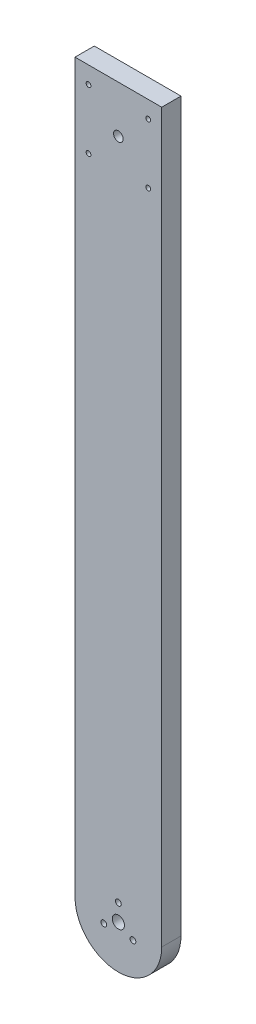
ISO-10303-21;
HEADER;
FILE_DESCRIPTION(('STEP AP214'),'2;1');
FILE_NAME('part.step','',(''),(''),'','','');
FILE_SCHEMA(('AUTOMOTIVE_DESIGN { 1 0 10303 214 1 1 1 1 }'));
ENDSEC;
DATA;
#1=APPLICATION_CONTEXT('core data for automotive mechanical design processes');
#2=APPLICATION_PROTOCOL_DEFINITION('international standard','automotive_design',2000,#1);
#3=PRODUCT_CONTEXT('',#1,'mechanical');
#4=PRODUCT('Part','Part','',(#3));
#5=PRODUCT_RELATED_PRODUCT_CATEGORY('part','',(#4));
#6=PRODUCT_DEFINITION_FORMATION('','',#4);
#7=PRODUCT_DEFINITION_CONTEXT('part definition',#1,'design');
#8=PRODUCT_DEFINITION('design','',#6,#7);
#9=PRODUCT_DEFINITION_SHAPE('','',#8);
#10=(LENGTH_UNIT() NAMED_UNIT(*) SI_UNIT(.MILLI.,.METRE.));
#11=(NAMED_UNIT(*) PLANE_ANGLE_UNIT() SI_UNIT($,.RADIAN.));
#12=(NAMED_UNIT(*) SI_UNIT($,.STERADIAN.) SOLID_ANGLE_UNIT());
#13=UNCERTAINTY_MEASURE_WITH_UNIT(LENGTH_MEASURE(1.E-05),#10,'distance_accuracy_value','');
#14=(GEOMETRIC_REPRESENTATION_CONTEXT(3) GLOBAL_UNCERTAINTY_ASSIGNED_CONTEXT((#13)) GLOBAL_UNIT_ASSIGNED_CONTEXT((#10,
#11,#12)) REPRESENTATION_CONTEXT('',''));
#15=CARTESIAN_POINT('',(0.,0.,0.));
#16=DIRECTION('',(0.,0.,1.));
#17=DIRECTION('',(1.,0.,0.));
#18=AXIS2_PLACEMENT_3D('',#15,#16,#17);
#19=CARTESIAN_POINT('',(-5.06539254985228E-12,-247.5,10.));
#20=DIRECTION('',(0.,0.,1.));
#21=DIRECTION('',(1.,0.,0.));
#22=AXIS2_PLACEMENT_3D('',#19,#20,#21);
#23=PLANE('',#22);
#24=CARTESIAN_POINT('',(7.57772228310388,-251.875000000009,10.));
#25=DIRECTION('',(0.,0.,1.));
#26=DIRECTION('',(1.,0.,0.));
#27=AXIS2_PLACEMENT_3D('',#24,#25,#26);
#28=CIRCLE('',#27,1.49999999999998);
#29=CARTESIAN_POINT('',(9.07772228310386,-251.875000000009,10.));
#30=VERTEX_POINT('',#29);
#31=EDGE_CURVE('E151',#30,#30,#28,.T.);
#32=ORIENTED_EDGE('',*,*,#31,.F.);
#33=EDGE_LOOP('',(#32));
#34=FACE_BOUND('',#33,.T.);
#35=CARTESIAN_POINT('',(5.46489483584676E-12,-238.75,10.));
#36=DIRECTION('',(0.,0.,1.));
#37=DIRECTION('',(1.,0.,0.));
#38=AXIS2_PLACEMENT_3D('',#35,#36,#37);
#39=CIRCLE('',#38,1.5);
#40=CARTESIAN_POINT('',(1.50000000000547,-238.75,10.));
#41=VERTEX_POINT('',#40);
#42=EDGE_CURVE('E139',#41,#41,#39,.T.);
#43=ORIENTED_EDGE('',*,*,#42,.F.);
#44=EDGE_LOOP('',(#43));
#45=FACE_BOUND('',#44,.T.);
#46=CARTESIAN_POINT('',(-15.4999999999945,90.1639203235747,10.));
#47=DIRECTION('',(0.,0.,1.));
#48=DIRECTION('',(-1.,0.,0.));
#49=AXIS2_PLACEMENT_3D('',#46,#47,#48);
#50=CIRCLE('',#49,1.25);
#51=CARTESIAN_POINT('',(-16.7499999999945,90.1639203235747,10.));
#52=VERTEX_POINT('',#51);
#53=EDGE_CURVE('E127',#52,#52,#50,.T.);
#54=ORIENTED_EDGE('',*,*,#53,.F.);
#55=EDGE_LOOP('',(#54));
#56=FACE_BOUND('',#55,.T.);
#57=CARTESIAN_POINT('',(15.5000000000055,121.163920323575,10.));
#58=DIRECTION('',(0.,0.,1.));
#59=DIRECTION('',(-1.,0.,0.));
#60=AXIS2_PLACEMENT_3D('',#57,#58,#59);
#61=CIRCLE('',#60,1.25);
#62=CARTESIAN_POINT('',(14.2500000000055,121.163920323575,10.));
#63=VERTEX_POINT('',#62);
#64=EDGE_CURVE('E115',#63,#63,#61,.T.);
#65=ORIENTED_EDGE('',*,*,#64,.F.);
#66=EDGE_LOOP('',(#65));
#67=FACE_BOUND('',#66,.T.);
#68=DIRECTION('',(0.,-1.,0.));
#69=VECTOR('',#68,1.);
#70=CARTESIAN_POINT('',(-22.5,130.,10.));
#71=LINE('',#70,#69);
#72=CARTESIAN_POINT('',(-22.5,130.,10.));
#73=VERTEX_POINT('',#72);
#74=CARTESIAN_POINT('',(-22.5000000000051,-247.5,10.));
#75=VERTEX_POINT('',#74);
#76=EDGE_CURVE('E85',#73,#75,#71,.T.);
#77=ORIENTED_EDGE('',*,*,#76,.T.);
#78=CARTESIAN_POINT('',(-5.06539254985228E-12,-247.5,10.));
#79=DIRECTION('',(0.,0.,1.));
#80=DIRECTION('',(1.,0.,0.));
#81=AXIS2_PLACEMENT_3D('',#78,#79,#80);
#82=CIRCLE('',#81,22.5);
#83=CARTESIAN_POINT('',(22.4999999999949,-247.5,10.));
#84=VERTEX_POINT('',#83);
#85=EDGE_CURVE('E80',#75,#84,#82,.T.);
#86=ORIENTED_EDGE('',*,*,#85,.T.);
#87=DIRECTION('',(0.,1.,0.));
#88=VECTOR('',#87,1.);
#89=CARTESIAN_POINT('',(22.5,130.,10.));
#90=LINE('',#89,#88);
#91=CARTESIAN_POINT('',(22.5,130.,10.));
#92=VERTEX_POINT('',#91);
#93=EDGE_CURVE('E83',#84,#92,#90,.T.);
#94=ORIENTED_EDGE('',*,*,#93,.T.);
#95=DIRECTION('',(-1.,0.,0.));
#96=VECTOR('',#95,1.);
#97=CARTESIAN_POINT('',(-22.5,130.,10.));
#98=LINE('',#97,#96);
#99=EDGE_CURVE('E50',#92,#73,#98,.T.);
#100=ORIENTED_EDGE('',*,*,#99,.T.);
#101=EDGE_LOOP('',(#77,#86,#94,#100));
#102=FACE_BOUND('',#101,.T.);
#103=CARTESIAN_POINT('',(-15.4999999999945,121.163920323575,10.));
#104=DIRECTION('',(0.,0.,1.));
#105=DIRECTION('',(1.,0.,0.));
#106=AXIS2_PLACEMENT_3D('',#103,#104,#105);
#107=CIRCLE('',#106,1.25);
#108=CARTESIAN_POINT('',(-14.2499999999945,121.163920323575,10.));
#109=VERTEX_POINT('',#108);
#110=EDGE_CURVE('E100',#109,#109,#107,.T.);
#111=ORIENTED_EDGE('',*,*,#110,.F.);
#112=EDGE_LOOP('',(#111));
#113=FACE_BOUND('',#112,.T.);
#114=CARTESIAN_POINT('',(15.5000000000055,90.1639203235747,10.));
#115=DIRECTION('',(0.,0.,1.));
#116=DIRECTION('',(1.,0.,0.));
#117=AXIS2_PLACEMENT_3D('',#114,#115,#116);
#118=CIRCLE('',#117,1.25);
#119=CARTESIAN_POINT('',(16.7500000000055,90.1639203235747,10.));
#120=VERTEX_POINT('',#119);
#121=EDGE_CURVE('E121',#120,#120,#118,.T.);
#122=ORIENTED_EDGE('',*,*,#121,.F.);
#123=EDGE_LOOP('',(#122));
#124=FACE_BOUND('',#123,.T.);
#125=CARTESIAN_POINT('',(5.4678483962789E-12,105.663920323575,10.));
#126=DIRECTION('',(0.,0.,1.));
#127=DIRECTION('',(1.,0.,0.));
#128=AXIS2_PLACEMENT_3D('',#125,#126,#127);
#129=CIRCLE('',#128,2.5);
#130=CARTESIAN_POINT('',(2.50000000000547,105.663920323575,10.));
#131=VERTEX_POINT('',#130);
#132=EDGE_CURVE('E133',#131,#131,#129,.T.);
#133=ORIENTED_EDGE('',*,*,#132,.F.);
#134=EDGE_LOOP('',(#133));
#135=FACE_BOUND('',#134,.T.);
#136=CARTESIAN_POINT('',(-5.06539254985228E-12,-247.5,10.));
#137=DIRECTION('',(0.,0.,1.));
#138=DIRECTION('',(1.,0.,0.));
#139=AXIS2_PLACEMENT_3D('',#136,#137,#138);
#140=CIRCLE('',#139,3.15000000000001);
#141=CARTESIAN_POINT('',(3.14999999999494,-247.5,10.));
#142=VERTEX_POINT('',#141);
#143=EDGE_CURVE('E145',#142,#142,#140,.T.);
#144=ORIENTED_EDGE('',*,*,#143,.F.);
#145=EDGE_LOOP('',(#144));
#146=FACE_BOUND('',#145,.T.);
#147=CARTESIAN_POINT('',(-7.57772228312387,-251.874999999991,10.));
#148=DIRECTION('',(0.,0.,1.));
#149=DIRECTION('',(1.,0.,0.));
#150=AXIS2_PLACEMENT_3D('',#147,#148,#149);
#151=CIRCLE('',#150,1.49999999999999);
#152=CARTESIAN_POINT('',(-6.07772228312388,-251.874999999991,10.));
#153=VERTEX_POINT('',#152);
#154=EDGE_CURVE('E157',#153,#153,#151,.T.);
#155=ORIENTED_EDGE('',*,*,#154,.F.);
#156=EDGE_LOOP('',(#155));
#157=FACE_BOUND('',#156,.T.);
#158=ADVANCED_FACE('F33',(#34,#45,#56,#67,#102,#113,#124,#135,#146,#157),#23,.T.);
#159=CARTESIAN_POINT('',(-5.06539254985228E-12,-247.5,0.));
#160=DIRECTION('',(0.,0.,1.));
#161=DIRECTION('',(1.,0.,0.));
#162=AXIS2_PLACEMENT_3D('',#159,#160,#161);
#163=PLANE('',#162);
#164=DIRECTION('',(0.,-1.,0.));
#165=VECTOR('',#164,1.);
#166=CARTESIAN_POINT('',(-22.5,130.,0.));
#167=LINE('',#166,#165);
#168=CARTESIAN_POINT('',(-22.5,130.,0.));
#169=VERTEX_POINT('',#168);
#170=CARTESIAN_POINT('',(-22.5000000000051,-247.5,0.));
#171=VERTEX_POINT('',#170);
#172=EDGE_CURVE('E97',#169,#171,#167,.T.);
#173=ORIENTED_EDGE('',*,*,#172,.F.);
#174=DIRECTION('',(-1.,0.,0.));
#175=VECTOR('',#174,1.);
#176=CARTESIAN_POINT('',(-22.5,130.,0.));
#177=LINE('',#176,#175);
#178=CARTESIAN_POINT('',(22.5,130.,0.));
#179=VERTEX_POINT('',#178);
#180=EDGE_CURVE('E73',#179,#169,#177,.T.);
#181=ORIENTED_EDGE('',*,*,#180,.F.);
#182=DIRECTION('',(0.,1.,0.));
#183=VECTOR('',#182,1.);
#184=CARTESIAN_POINT('',(22.5,130.,0.));
#185=LINE('',#184,#183);
#186=CARTESIAN_POINT('',(22.4999999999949,-247.5,0.));
#187=VERTEX_POINT('',#186);
#188=EDGE_CURVE('E67',#187,#179,#185,.T.);
#189=ORIENTED_EDGE('',*,*,#188,.F.);
#190=CARTESIAN_POINT('',(-5.06539254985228E-12,-247.5,0.));
#191=DIRECTION('',(0.,0.,1.));
#192=DIRECTION('',(1.,0.,0.));
#193=AXIS2_PLACEMENT_3D('',#190,#191,#192);
#194=CIRCLE('',#193,22.5);
#195=EDGE_CURVE('E89',#171,#187,#194,.T.);
#196=ORIENTED_EDGE('',*,*,#195,.F.);
#197=EDGE_LOOP('',(#173,#181,#189,#196));
#198=FACE_BOUND('',#197,.T.);
#199=CARTESIAN_POINT('',(-15.4999999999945,121.163920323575,0.));
#200=DIRECTION('',(0.,0.,1.));
#201=DIRECTION('',(1.,0.,0.));
#202=AXIS2_PLACEMENT_3D('',#199,#200,#201);
#203=CIRCLE('',#202,1.25);
#204=CARTESIAN_POINT('',(-14.2499999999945,121.163920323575,0.));
#205=VERTEX_POINT('',#204);
#206=EDGE_CURVE('E112',#205,#205,#203,.T.);
#207=ORIENTED_EDGE('',*,*,#206,.T.);
#208=EDGE_LOOP('',(#207));
#209=FACE_BOUND('',#208,.T.);
#210=CARTESIAN_POINT('',(15.5000000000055,121.163920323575,0.));
#211=DIRECTION('',(0.,0.,1.));
#212=DIRECTION('',(-1.,0.,0.));
#213=AXIS2_PLACEMENT_3D('',#210,#211,#212);
#214=CIRCLE('',#213,1.25);
#215=CARTESIAN_POINT('',(14.2500000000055,121.163920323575,0.));
#216=VERTEX_POINT('',#215);
#217=EDGE_CURVE('E118',#216,#216,#214,.T.);
#218=ORIENTED_EDGE('',*,*,#217,.T.);
#219=EDGE_LOOP('',(#218));
#220=FACE_BOUND('',#219,.T.);
#221=CARTESIAN_POINT('',(15.5000000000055,90.1639203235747,0.));
#222=DIRECTION('',(0.,0.,1.));
#223=DIRECTION('',(1.,0.,0.));
#224=AXIS2_PLACEMENT_3D('',#221,#222,#223);
#225=CIRCLE('',#224,1.25);
#226=CARTESIAN_POINT('',(16.7500000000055,90.1639203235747,0.));
#227=VERTEX_POINT('',#226);
#228=EDGE_CURVE('E124',#227,#227,#225,.T.);
#229=ORIENTED_EDGE('',*,*,#228,.T.);
#230=EDGE_LOOP('',(#229));
#231=FACE_BOUND('',#230,.T.);
#232=CARTESIAN_POINT('',(-15.4999999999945,90.1639203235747,0.));
#233=DIRECTION('',(0.,0.,1.));
#234=DIRECTION('',(-1.,0.,0.));
#235=AXIS2_PLACEMENT_3D('',#232,#233,#234);
#236=CIRCLE('',#235,1.25);
#237=CARTESIAN_POINT('',(-16.7499999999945,90.1639203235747,0.));
#238=VERTEX_POINT('',#237);
#239=EDGE_CURVE('E130',#238,#238,#236,.T.);
#240=ORIENTED_EDGE('',*,*,#239,.T.);
#241=EDGE_LOOP('',(#240));
#242=FACE_BOUND('',#241,.T.);
#243=CARTESIAN_POINT('',(5.4678483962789E-12,105.663920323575,0.));
#244=DIRECTION('',(0.,0.,1.));
#245=DIRECTION('',(1.,0.,0.));
#246=AXIS2_PLACEMENT_3D('',#243,#244,#245);
#247=CIRCLE('',#246,2.5);
#248=CARTESIAN_POINT('',(2.50000000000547,105.663920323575,0.));
#249=VERTEX_POINT('',#248);
#250=EDGE_CURVE('E136',#249,#249,#247,.T.);
#251=ORIENTED_EDGE('',*,*,#250,.T.);
#252=EDGE_LOOP('',(#251));
#253=FACE_BOUND('',#252,.T.);
#254=CARTESIAN_POINT('',(5.46489483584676E-12,-238.75,0.));
#255=DIRECTION('',(0.,0.,1.));
#256=DIRECTION('',(1.,0.,0.));
#257=AXIS2_PLACEMENT_3D('',#254,#255,#256);
#258=CIRCLE('',#257,1.5);
#259=CARTESIAN_POINT('',(1.50000000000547,-238.75,0.));
#260=VERTEX_POINT('',#259);
#261=EDGE_CURVE('E142',#260,#260,#258,.T.);
#262=ORIENTED_EDGE('',*,*,#261,.T.);
#263=EDGE_LOOP('',(#262));
#264=FACE_BOUND('',#263,.T.);
#265=CARTESIAN_POINT('',(-5.06539254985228E-12,-247.5,0.));
#266=DIRECTION('',(0.,0.,1.));
#267=DIRECTION('',(1.,0.,0.));
#268=AXIS2_PLACEMENT_3D('',#265,#266,#267);
#269=CIRCLE('',#268,3.15000000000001);
#270=CARTESIAN_POINT('',(3.14999999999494,-247.5,0.));
#271=VERTEX_POINT('',#270);
#272=EDGE_CURVE('E148',#271,#271,#269,.T.);
#273=ORIENTED_EDGE('',*,*,#272,.T.);
#274=EDGE_LOOP('',(#273));
#275=FACE_BOUND('',#274,.T.);
#276=CARTESIAN_POINT('',(7.57772228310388,-251.875000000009,0.));
#277=DIRECTION('',(0.,0.,1.));
#278=DIRECTION('',(1.,0.,0.));
#279=AXIS2_PLACEMENT_3D('',#276,#277,#278);
#280=CIRCLE('',#279,1.49999999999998);
#281=CARTESIAN_POINT('',(9.07772228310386,-251.875000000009,0.));
#282=VERTEX_POINT('',#281);
#283=EDGE_CURVE('E154',#282,#282,#280,.T.);
#284=ORIENTED_EDGE('',*,*,#283,.T.);
#285=EDGE_LOOP('',(#284));
#286=FACE_BOUND('',#285,.T.);
#287=CARTESIAN_POINT('',(-7.57772228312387,-251.874999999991,0.));
#288=DIRECTION('',(0.,0.,1.));
#289=DIRECTION('',(1.,0.,0.));
#290=AXIS2_PLACEMENT_3D('',#287,#288,#289);
#291=CIRCLE('',#290,1.49999999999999);
#292=CARTESIAN_POINT('',(-6.07772228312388,-251.874999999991,0.));
#293=VERTEX_POINT('',#292);
#294=EDGE_CURVE('E160',#293,#293,#291,.T.);
#295=ORIENTED_EDGE('',*,*,#294,.T.);
#296=EDGE_LOOP('',(#295));
#297=FACE_BOUND('',#296,.T.);
#298=ADVANCED_FACE('F108',(#198,#209,#220,#231,#242,#253,#264,#275,#286,#297),#163,.F.);
#299=CARTESIAN_POINT('',(-22.5,130.,10.));
#300=DIRECTION('',(1.,0.,0.));
#301=DIRECTION('',(0.,1.,0.));
#302=AXIS2_PLACEMENT_3D('',#299,#300,#301);
#303=PLANE('',#302);
#304=ORIENTED_EDGE('',*,*,#172,.T.);
#305=DIRECTION('',(0.,0.,-1.));
#306=VECTOR('',#305,1.);
#307=CARTESIAN_POINT('',(-22.5000000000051,-247.5,10.));
#308=LINE('',#307,#306);
#309=EDGE_CURVE('E11',#75,#171,#308,.T.);
#310=ORIENTED_EDGE('',*,*,#309,.F.);
#311=ORIENTED_EDGE('',*,*,#76,.F.);
#312=DIRECTION('',(0.,0.,-1.));
#313=VECTOR('',#312,1.);
#314=CARTESIAN_POINT('',(-22.5,130.,10.));
#315=LINE('',#314,#313);
#316=EDGE_CURVE('E93',#73,#169,#315,.T.);
#317=ORIENTED_EDGE('',*,*,#316,.T.);
#318=EDGE_LOOP('',(#304,#310,#311,#317));
#319=FACE_BOUND('',#318,.T.);
#320=ADVANCED_FACE('F35',(#319),#303,.F.);
#321=CARTESIAN_POINT('',(-5.06539254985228E-12,-247.5,10.));
#322=DIRECTION('',(0.,0.,-1.));
#323=DIRECTION('',(-1.,0.,0.));
#324=AXIS2_PLACEMENT_3D('',#321,#322,#323);
#325=CYLINDRICAL_SURFACE('',#324,22.5);
#326=ORIENTED_EDGE('',*,*,#195,.T.);
#327=DIRECTION('',(0.,0.,-1.));
#328=VECTOR('',#327,1.);
#329=CARTESIAN_POINT('',(22.4999999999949,-247.5,10.));
#330=LINE('',#329,#328);
#331=EDGE_CURVE('E42',#84,#187,#330,.T.);
#332=ORIENTED_EDGE('',*,*,#331,.F.);
#333=ORIENTED_EDGE('',*,*,#85,.F.);
#334=ORIENTED_EDGE('',*,*,#309,.T.);
#335=EDGE_LOOP('',(#326,#332,#333,#334));
#336=FACE_BOUND('',#335,.T.);
#337=ADVANCED_FACE('F88',(#336),#325,.T.);
#338=CARTESIAN_POINT('',(22.5,130.,10.));
#339=DIRECTION('',(-1.,0.,0.));
#340=DIRECTION('',(0.,-1.,0.));
#341=AXIS2_PLACEMENT_3D('',#338,#339,#340);
#342=PLANE('',#341);
#343=ORIENTED_EDGE('',*,*,#188,.T.);
#344=DIRECTION('',(0.,0.,-1.));
#345=VECTOR('',#344,1.);
#346=CARTESIAN_POINT('',(22.5,130.,10.));
#347=LINE('',#346,#345);
#348=EDGE_CURVE('E90',#92,#179,#347,.T.);
#349=ORIENTED_EDGE('',*,*,#348,.F.);
#350=ORIENTED_EDGE('',*,*,#93,.F.);
#351=ORIENTED_EDGE('',*,*,#331,.T.);
#352=EDGE_LOOP('',(#343,#349,#350,#351));
#353=FACE_BOUND('',#352,.T.);
#354=ADVANCED_FACE('F91',(#353),#342,.F.);
#355=CARTESIAN_POINT('',(-22.5,130.,10.));
#356=DIRECTION('',(0.,-1.,0.));
#357=DIRECTION('',(0.,0.,-1.));
#358=AXIS2_PLACEMENT_3D('',#355,#356,#357);
#359=PLANE('',#358);
#360=ORIENTED_EDGE('',*,*,#180,.T.);
#361=ORIENTED_EDGE('',*,*,#316,.F.);
#362=ORIENTED_EDGE('',*,*,#99,.F.);
#363=ORIENTED_EDGE('',*,*,#348,.T.);
#364=EDGE_LOOP('',(#360,#361,#362,#363));
#365=FACE_BOUND('',#364,.T.);
#366=ADVANCED_FACE('F105',(#365),#359,.F.);
#367=CARTESIAN_POINT('',(-15.4999999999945,121.163920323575,10.));
#368=DIRECTION('',(0.,0.,-1.));
#369=DIRECTION('',(-1.,0.,0.));
#370=AXIS2_PLACEMENT_3D('',#367,#368,#369);
#371=CYLINDRICAL_SURFACE('',#370,1.25);
#372=ORIENTED_EDGE('',*,*,#110,.T.);
#373=EDGE_LOOP('',(#372));
#374=FACE_BOUND('',#373,.T.);
#375=ORIENTED_EDGE('',*,*,#206,.F.);
#376=EDGE_LOOP('',(#375));
#377=FACE_BOUND('',#376,.T.);
#378=ADVANCED_FACE('F179',(#374,#377),#371,.F.);
#379=CARTESIAN_POINT('',(15.5000000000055,121.163920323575,10.));
#380=DIRECTION('',(0.,0.,-1.));
#381=DIRECTION('',(-1.,0.,0.));
#382=AXIS2_PLACEMENT_3D('',#379,#380,#381);
#383=CYLINDRICAL_SURFACE('',#382,1.25);
#384=ORIENTED_EDGE('',*,*,#64,.T.);
#385=EDGE_LOOP('',(#384));
#386=FACE_BOUND('',#385,.T.);
#387=ORIENTED_EDGE('',*,*,#217,.F.);
#388=EDGE_LOOP('',(#387));
#389=FACE_BOUND('',#388,.T.);
#390=ADVANCED_FACE('F225',(#386,#389),#383,.F.);
#391=CARTESIAN_POINT('',(15.5000000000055,90.1639203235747,10.));
#392=DIRECTION('',(0.,0.,-1.));
#393=DIRECTION('',(-1.,0.,0.));
#394=AXIS2_PLACEMENT_3D('',#391,#392,#393);
#395=CYLINDRICAL_SURFACE('',#394,1.25);
#396=ORIENTED_EDGE('',*,*,#121,.T.);
#397=EDGE_LOOP('',(#396));
#398=FACE_BOUND('',#397,.T.);
#399=ORIENTED_EDGE('',*,*,#228,.F.);
#400=EDGE_LOOP('',(#399));
#401=FACE_BOUND('',#400,.T.);
#402=ADVANCED_FACE('F233',(#398,#401),#395,.F.);
#403=CARTESIAN_POINT('',(-15.4999999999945,90.1639203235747,10.));
#404=DIRECTION('',(0.,0.,-1.));
#405=DIRECTION('',(-1.,0.,0.));
#406=AXIS2_PLACEMENT_3D('',#403,#404,#405);
#407=CYLINDRICAL_SURFACE('',#406,1.25);
#408=ORIENTED_EDGE('',*,*,#53,.T.);
#409=EDGE_LOOP('',(#408));
#410=FACE_BOUND('',#409,.T.);
#411=ORIENTED_EDGE('',*,*,#239,.F.);
#412=EDGE_LOOP('',(#411));
#413=FACE_BOUND('',#412,.T.);
#414=ADVANCED_FACE('F241',(#410,#413),#407,.F.);
#415=CARTESIAN_POINT('',(5.4678483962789E-12,105.663920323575,10.));
#416=DIRECTION('',(0.,0.,-1.));
#417=DIRECTION('',(-1.,0.,0.));
#418=AXIS2_PLACEMENT_3D('',#415,#416,#417);
#419=CYLINDRICAL_SURFACE('',#418,2.5);
#420=ORIENTED_EDGE('',*,*,#132,.T.);
#421=EDGE_LOOP('',(#420));
#422=FACE_BOUND('',#421,.T.);
#423=ORIENTED_EDGE('',*,*,#250,.F.);
#424=EDGE_LOOP('',(#423));
#425=FACE_BOUND('',#424,.T.);
#426=ADVANCED_FACE('F250',(#422,#425),#419,.F.);
#427=CARTESIAN_POINT('',(5.46489483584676E-12,-238.75,10.));
#428=DIRECTION('',(0.,0.,-1.));
#429=DIRECTION('',(-1.,0.,0.));
#430=AXIS2_PLACEMENT_3D('',#427,#428,#429);
#431=CYLINDRICAL_SURFACE('',#430,1.5);
#432=ORIENTED_EDGE('',*,*,#42,.T.);
#433=EDGE_LOOP('',(#432));
#434=FACE_BOUND('',#433,.T.);
#435=ORIENTED_EDGE('',*,*,#261,.F.);
#436=EDGE_LOOP('',(#435));
#437=FACE_BOUND('',#436,.T.);
#438=ADVANCED_FACE('F259',(#434,#437),#431,.F.);
#439=CARTESIAN_POINT('',(-5.06539254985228E-12,-247.5,10.));
#440=DIRECTION('',(0.,0.,-1.));
#441=DIRECTION('',(-1.,0.,0.));
#442=AXIS2_PLACEMENT_3D('',#439,#440,#441);
#443=CYLINDRICAL_SURFACE('',#442,3.15000000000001);
#444=ORIENTED_EDGE('',*,*,#143,.T.);
#445=EDGE_LOOP('',(#444));
#446=FACE_BOUND('',#445,.T.);
#447=ORIENTED_EDGE('',*,*,#272,.F.);
#448=EDGE_LOOP('',(#447));
#449=FACE_BOUND('',#448,.T.);
#450=ADVANCED_FACE('F268',(#446,#449),#443,.F.);
#451=CARTESIAN_POINT('',(7.57772228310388,-251.875000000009,10.));
#452=DIRECTION('',(0.,0.,-1.));
#453=DIRECTION('',(-1.,0.,0.));
#454=AXIS2_PLACEMENT_3D('',#451,#452,#453);
#455=CYLINDRICAL_SURFACE('',#454,1.49999999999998);
#456=ORIENTED_EDGE('',*,*,#31,.T.);
#457=EDGE_LOOP('',(#456));
#458=FACE_BOUND('',#457,.T.);
#459=ORIENTED_EDGE('',*,*,#283,.F.);
#460=EDGE_LOOP('',(#459));
#461=FACE_BOUND('',#460,.T.);
#462=ADVANCED_FACE('F277',(#458,#461),#455,.F.);
#463=CARTESIAN_POINT('',(-7.57772228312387,-251.874999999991,10.));
#464=DIRECTION('',(0.,0.,-1.));
#465=DIRECTION('',(-1.,0.,0.));
#466=AXIS2_PLACEMENT_3D('',#463,#464,#465);
#467=CYLINDRICAL_SURFACE('',#466,1.49999999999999);
#468=ORIENTED_EDGE('',*,*,#154,.T.);
#469=EDGE_LOOP('',(#468));
#470=FACE_BOUND('',#469,.T.);
#471=ORIENTED_EDGE('',*,*,#294,.F.);
#472=EDGE_LOOP('',(#471));
#473=FACE_BOUND('',#472,.T.);
#474=ADVANCED_FACE('F166',(#470,#473),#467,.F.);
#475=CLOSED_SHELL('',(#158,#298,#320,#337,#354,#366,#378,#390,#402,#414,#426,#438,#450,#462,#474));
#476=MANIFOLD_SOLID_BREP('B2',#475);
#477=ADVANCED_BREP_SHAPE_REPRESENTATION('',(#18,#476),#14);
#478=SHAPE_DEFINITION_REPRESENTATION(#9,#477);
ENDSEC;
END-ISO-10303-21;
